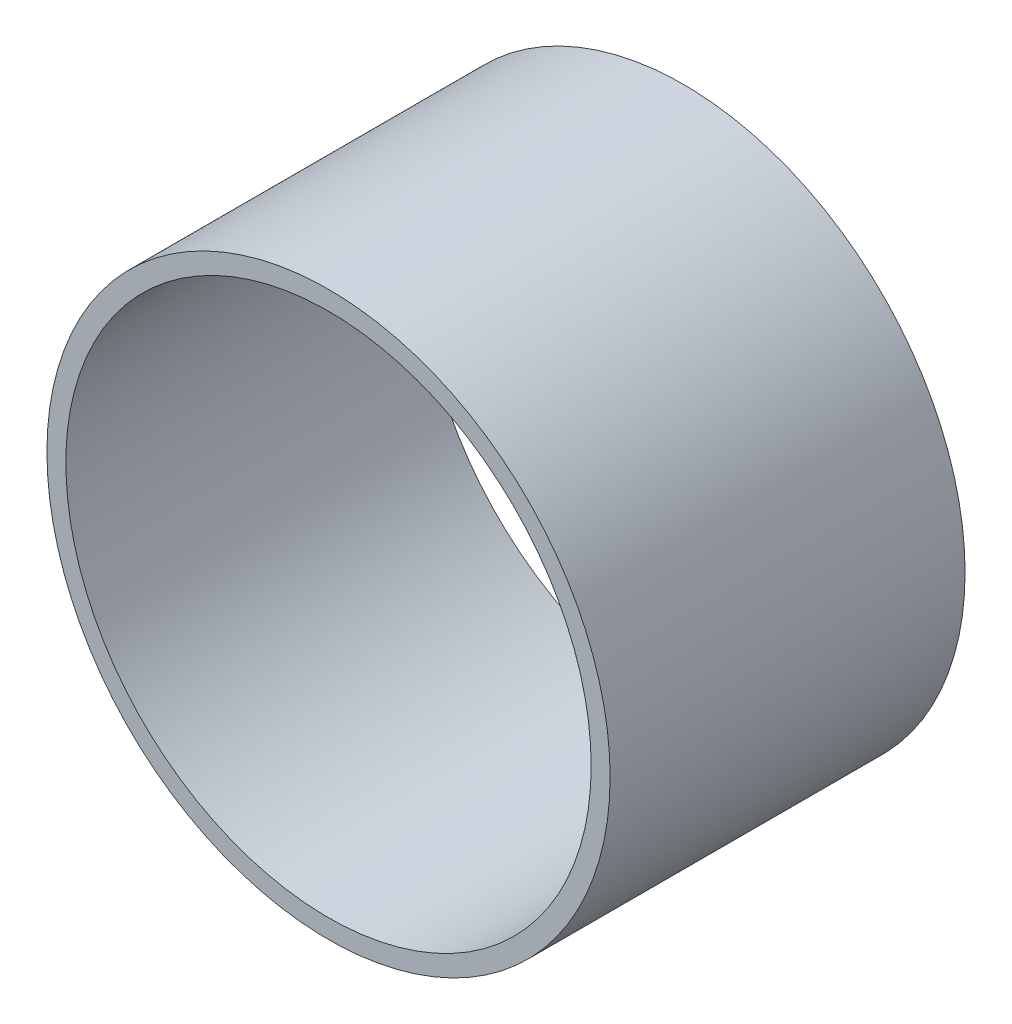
from build123d import *

# Parameters (mm, degrees)
ESQUISSE1_R      = 11.9
ESQUISSE1_R_2    = 11.1
EXTRUSION1_DEPTH = 15


with BuildPart() as part:
    # Esquisse1 → Extrusion1 (new body)
    with BuildSketch(Plane.XY):
        Circle(ESQUISSE1_R)
        Circle(ESQUISSE1_R_2, mode=Mode.SUBTRACT)
    extrude(amount=EXTRUSION1_DEPTH)


solid = part.part
